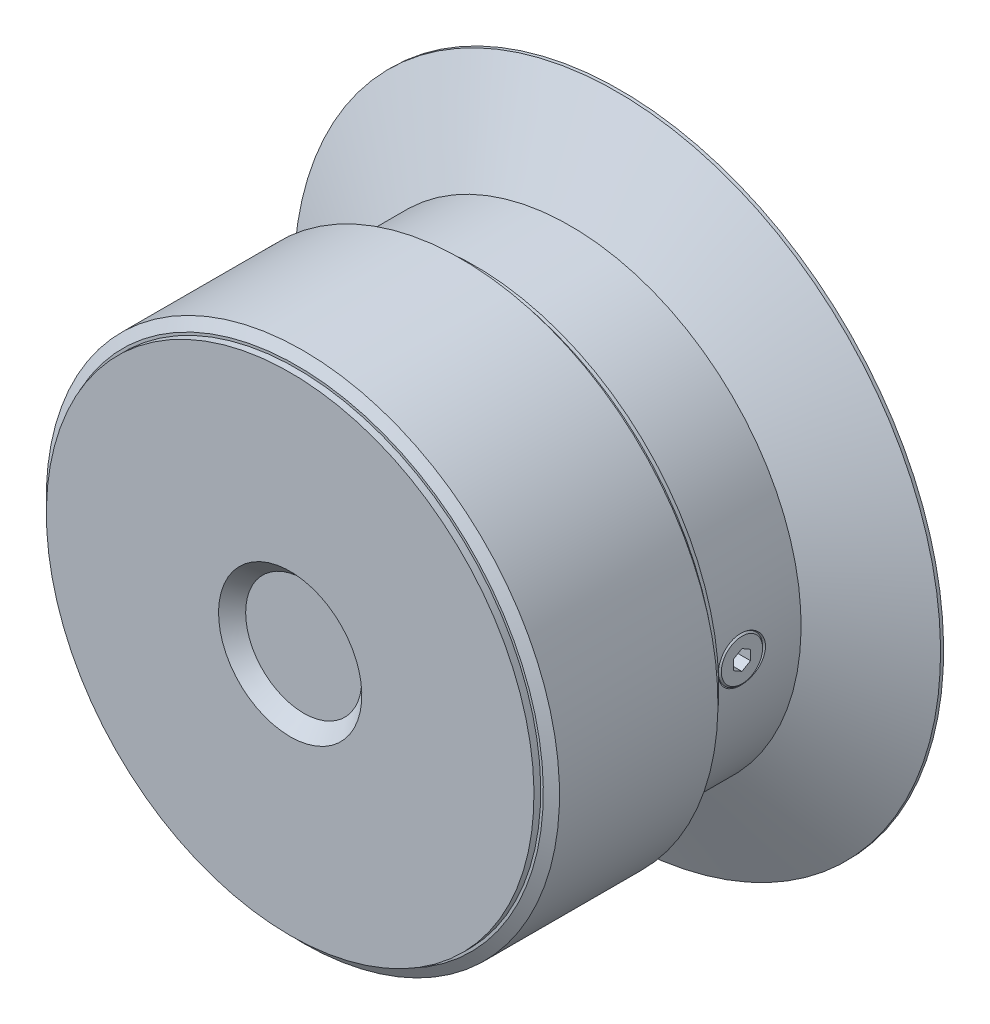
ISO-10303-21;
HEADER;
FILE_DESCRIPTION(('STEP AP214'),'2;1');
FILE_NAME('part.step','',(''),(''),'','','');
FILE_SCHEMA(('AUTOMOTIVE_DESIGN { 1 0 10303 214 1 1 1 1 }'));
ENDSEC;
DATA;
#1=APPLICATION_CONTEXT('core data for automotive mechanical design processes');
#2=APPLICATION_PROTOCOL_DEFINITION('international standard','automotive_design',2000,#1);
#3=PRODUCT_CONTEXT('',#1,'mechanical');
#4=PRODUCT('Part','Part','',(#3));
#5=PRODUCT_RELATED_PRODUCT_CATEGORY('part','',(#4));
#6=PRODUCT_DEFINITION_FORMATION('','',#4);
#7=PRODUCT_DEFINITION_CONTEXT('part definition',#1,'design');
#8=PRODUCT_DEFINITION('design','',#6,#7);
#9=PRODUCT_DEFINITION_SHAPE('','',#8);
#10=(LENGTH_UNIT() NAMED_UNIT(*) SI_UNIT(.MILLI.,.METRE.));
#11=(NAMED_UNIT(*) PLANE_ANGLE_UNIT() SI_UNIT($,.RADIAN.));
#12=(NAMED_UNIT(*) SI_UNIT($,.STERADIAN.) SOLID_ANGLE_UNIT());
#13=UNCERTAINTY_MEASURE_WITH_UNIT(LENGTH_MEASURE(1.E-05),#10,'distance_accuracy_value','');
#14=(GEOMETRIC_REPRESENTATION_CONTEXT(3) GLOBAL_UNCERTAINTY_ASSIGNED_CONTEXT((#13)) GLOBAL_UNIT_ASSIGNED_CONTEXT((#10,
#11,#12)) REPRESENTATION_CONTEXT('',''));
#15=CARTESIAN_POINT('',(0.,0.,0.));
#16=DIRECTION('',(0.,0.,1.));
#17=DIRECTION('',(1.,0.,0.));
#18=AXIS2_PLACEMENT_3D('',#15,#16,#17);
#19=CARTESIAN_POINT('',(0.,0.,33.));
#20=DIRECTION('',(0.,0.,1.));
#21=DIRECTION('',(0.,-1.,0.));
#22=AXIS2_PLACEMENT_3D('',#19,#20,#21);
#23=CYLINDRICAL_SURFACE('',#22,25.);
#24=CARTESIAN_POINT('',(0.,0.,31.7626497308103));
#25=DIRECTION('',(0.,0.,-1.));
#26=DIRECTION('',(0.,1.,0.));
#27=AXIS2_PLACEMENT_3D('',#24,#25,#26);
#28=CIRCLE('',#27,25.);
#29=CARTESIAN_POINT('',(0.,25.,31.7626497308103));
#30=VERTEX_POINT('',#29);
#31=EDGE_CURVE('E139',#30,#30,#28,.T.);
#32=ORIENTED_EDGE('',*,*,#31,.T.);
#33=EDGE_LOOP('',(#32));
#34=FACE_BOUND('',#33,.T.);
#35=CARTESIAN_POINT('',(0.,0.,16.3273502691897));
#36=DIRECTION('',(0.,0.,1.));
#37=DIRECTION('',(0.,-1.,0.));
#38=AXIS2_PLACEMENT_3D('',#35,#36,#37);
#39=CIRCLE('',#38,25.);
#40=CARTESIAN_POINT('',(0.,-25.,16.3273502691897));
#41=VERTEX_POINT('',#40);
#42=EDGE_CURVE('E142',#41,#41,#39,.T.);
#43=ORIENTED_EDGE('',*,*,#42,.T.);
#44=EDGE_LOOP('',(#43));
#45=FACE_BOUND('',#44,.T.);
#46=ADVANCED_FACE('F14',(#34,#45),#23,.T.);
#47=CARTESIAN_POINT('',(0.,0.,15.75));
#48=DIRECTION('',(0.,0.,1.));
#49=DIRECTION('',(0.,-1.,0.));
#50=AXIS2_PLACEMENT_3D('',#47,#48,#49);
#51=CONICAL_SURFACE('',#50,24.,1.0471975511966);
#52=ORIENTED_EDGE('',*,*,#42,.F.);
#53=EDGE_LOOP('',(#52));
#54=FACE_BOUND('',#53,.T.);
#55=CARTESIAN_POINT('',(0.,0.,15.75));
#56=DIRECTION('',(0.,0.,1.));
#57=DIRECTION('',(0.,-1.,0.));
#58=AXIS2_PLACEMENT_3D('',#55,#56,#57);
#59=CIRCLE('',#58,24.);
#60=CARTESIAN_POINT('',(0.,-24.,15.75));
#61=VERTEX_POINT('',#60);
#62=EDGE_CURVE('E135',#61,#61,#59,.T.);
#63=ORIENTED_EDGE('',*,*,#62,.T.);
#64=EDGE_LOOP('',(#63));
#65=FACE_BOUND('',#64,.T.);
#66=ADVANCED_FACE('F238',(#54,#65),#51,.T.);
#67=CARTESIAN_POINT('',(0.,0.,33.));
#68=DIRECTION('',(0.,0.,1.));
#69=DIRECTION('',(0.,-1.,0.));
#70=AXIS2_PLACEMENT_3D('',#67,#68,#69);
#71=CYLINDRICAL_SURFACE('',#70,24.);
#72=ORIENTED_EDGE('',*,*,#62,.F.);
#73=EDGE_LOOP('',(#72));
#74=FACE_BOUND('',#73,.T.);
#75=CARTESIAN_POINT('',(0.,0.,15.51));
#76=DIRECTION('',(0.,0.,1.));
#77=DIRECTION('',(0.,-1.,0.));
#78=AXIS2_PLACEMENT_3D('',#75,#76,#77);
#79=CIRCLE('',#78,24.);
#80=CARTESIAN_POINT('',(0.,-24.,15.51));
#81=VERTEX_POINT('',#80);
#82=EDGE_CURVE('E145',#81,#81,#79,.F.);
#83=ORIENTED_EDGE('',*,*,#82,.F.);
#84=EDGE_LOOP('',(#83));
#85=FACE_BOUND('',#84,.T.);
#86=ADVANCED_FACE('F244',(#74,#85),#71,.T.);
#87=CARTESIAN_POINT('',(23.75,0.,15.51));
#88=DIRECTION('',(0.,0.,1.));
#89=DIRECTION('',(0.,-1.,0.));
#90=AXIS2_PLACEMENT_3D('',#87,#88,#89);
#91=PLANE('',#90);
#92=ORIENTED_EDGE('',*,*,#82,.T.);
#93=EDGE_LOOP('',(#92));
#94=FACE_BOUND('',#93,.T.);
#95=CARTESIAN_POINT('',(0.,0.,15.51));
#96=DIRECTION('',(0.,0.,1.));
#97=DIRECTION('',(0.,-1.,0.));
#98=AXIS2_PLACEMENT_3D('',#95,#96,#97);
#99=CIRCLE('',#98,23.75);
#100=CARTESIAN_POINT('',(0.,-23.75,15.51));
#101=VERTEX_POINT('',#100);
#102=EDGE_CURVE('E163',#101,#101,#99,.T.);
#103=ORIENTED_EDGE('',*,*,#102,.T.);
#104=EDGE_LOOP('',(#103));
#105=FACE_BOUND('',#104,.T.);
#106=ADVANCED_FACE('F240',(#94,#105),#91,.F.);
#107=CARTESIAN_POINT('',(0.,0.,33.));
#108=DIRECTION('',(0.,0.,1.));
#109=DIRECTION('',(0.,-1.,0.));
#110=AXIS2_PLACEMENT_3D('',#107,#108,#109);
#111=CYLINDRICAL_SURFACE('',#110,23.75);
#112=ORIENTED_EDGE('',*,*,#102,.F.);
#113=EDGE_LOOP('',(#112));
#114=FACE_BOUND('',#113,.T.);
#115=CARTESIAN_POINT('',(0.,0.,15.));
#116=DIRECTION('',(0.,0.,1.));
#117=DIRECTION('',(0.,-1.,0.));
#118=AXIS2_PLACEMENT_3D('',#115,#116,#117);
#119=CIRCLE('',#118,23.75);
#120=CARTESIAN_POINT('',(0.,-23.75,15.));
#121=VERTEX_POINT('',#120);
#122=EDGE_CURVE('E166',#121,#121,#119,.T.);
#123=ORIENTED_EDGE('',*,*,#122,.T.);
#124=EDGE_LOOP('',(#123));
#125=FACE_BOUND('',#124,.T.);
#126=ADVANCED_FACE('F243',(#114,#125),#111,.T.);
#127=CARTESIAN_POINT('',(22.5,0.,15.));
#128=DIRECTION('',(0.,0.,1.));
#129=DIRECTION('',(0.,-1.,0.));
#130=AXIS2_PLACEMENT_3D('',#127,#128,#129);
#131=PLANE('',#130);
#132=ORIENTED_EDGE('',*,*,#122,.F.);
#133=EDGE_LOOP('',(#132));
#134=FACE_BOUND('',#133,.T.);
#135=CARTESIAN_POINT('',(0.,0.,15.));
#136=DIRECTION('',(0.,0.,1.));
#137=DIRECTION('',(0.,-1.,0.));
#138=AXIS2_PLACEMENT_3D('',#135,#136,#137);
#139=CIRCLE('',#138,22.5);
#140=CARTESIAN_POINT('',(0.,-22.5,15.));
#141=VERTEX_POINT('',#140);
#142=EDGE_CURVE('E169',#141,#141,#139,.T.);
#143=ORIENTED_EDGE('',*,*,#142,.T.);
#144=EDGE_LOOP('',(#143));
#145=FACE_BOUND('',#144,.T.);
#146=ADVANCED_FACE('F248',(#134,#145),#131,.F.);
#147=CARTESIAN_POINT('',(0.,0.,33.));
#148=DIRECTION('',(0.,0.,1.));
#149=DIRECTION('',(0.,-1.,0.));
#150=AXIS2_PLACEMENT_3D('',#147,#148,#149);
#151=CYLINDRICAL_SURFACE('',#150,22.5);
#152=ORIENTED_EDGE('',*,*,#142,.F.);
#153=EDGE_LOOP('',(#152));
#154=FACE_BOUND('',#153,.T.);
#155=CARTESIAN_POINT('',(22.4449005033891,-1.57367131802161,9.89902003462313));
#156=CARTESIAN_POINT('',(22.4501885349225,-1.49824527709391,9.81746639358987));
#157=CARTESIAN_POINT('',(22.4555177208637,-1.41678298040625,9.74147847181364));
#158=CARTESIAN_POINT('',(22.4657900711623,-1.24331217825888,9.60255135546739));
#159=CARTESIAN_POINT('',(22.470733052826,-1.15129873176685,9.53961831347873));
#160=CARTESIAN_POINT('',(22.4803216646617,-0.946988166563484,9.42188347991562));
#161=CARTESIAN_POINT('',(22.4848595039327,-0.833583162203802,9.3689782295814));
#162=CARTESIAN_POINT('',(22.4923255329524,-0.599185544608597,9.28386215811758));
#163=CARTESIAN_POINT('',(22.4952536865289,-0.478192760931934,9.25165180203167));
#164=CARTESIAN_POINT('',(22.499053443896,-0.237595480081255,9.21014008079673));
#165=CARTESIAN_POINT('',(22.5000069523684,-0.118149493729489,9.19992560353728));
#166=CARTESIAN_POINT('',(22.4999929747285,0.120711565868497,9.20007518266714));
#167=CARTESIAN_POINT('',(22.4990258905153,0.240126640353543,9.21043493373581));
#168=CARTESIAN_POINT('',(22.4953234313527,0.472989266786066,9.25089596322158));
#169=CARTESIAN_POINT('',(22.4926247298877,0.5865089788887,9.28058799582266));
#170=CARTESIAN_POINT('',(22.4857918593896,0.807062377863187,9.35823586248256));
#171=CARTESIAN_POINT('',(22.4816575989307,0.9140956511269,9.40619285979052));
#172=CARTESIAN_POINT('',(22.4723134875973,1.12072305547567,9.51972202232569));
#173=CARTESIAN_POINT('',(22.4670863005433,1.22015686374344,9.58558399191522));
#174=CARTESIAN_POINT('',(22.4561529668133,1.40711810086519,9.7324165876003));
#175=CARTESIAN_POINT('',(22.4504467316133,1.49464332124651,9.81339000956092));
#176=CARTESIAN_POINT('',(22.4388879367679,1.65934563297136,9.99184784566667));
#177=CARTESIAN_POINT('',(22.4330396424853,1.73591558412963,10.0898926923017));
#178=CARTESIAN_POINT('',(22.4220639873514,1.87236355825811,10.2970114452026));
#179=CARTESIAN_POINT('',(22.4169367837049,1.93223794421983,10.4060877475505));
#180=CARTESIAN_POINT('',(22.4077217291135,2.03638851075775,10.6374772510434));
#181=CARTESIAN_POINT('',(22.4036914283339,2.07983597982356,10.7601661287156));
#182=CARTESIAN_POINT('',(22.3974264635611,2.1462538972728,11.011012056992));
#183=CARTESIAN_POINT('',(22.3951921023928,2.16922089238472,11.1391700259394));
#184=CARTESIAN_POINT('',(22.3927228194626,2.19457076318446,11.4013368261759));
#185=CARTESIAN_POINT('',(22.3925485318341,2.19632944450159,11.535406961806));
#186=CARTESIAN_POINT('',(22.394377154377,2.17760329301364,11.8019791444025));
#187=CARTESIAN_POINT('',(22.3963802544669,2.15711651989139,11.9344810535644));
#188=CARTESIAN_POINT('',(22.4023598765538,2.09410479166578,12.1951352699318));
#189=CARTESIAN_POINT('',(22.4063507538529,2.05141942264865,12.3232485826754));
#190=CARTESIAN_POINT('',(22.4158499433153,1.94486944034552,12.5703021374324));
#191=CARTESIAN_POINT('',(22.4213582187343,1.88100533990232,12.6892426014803));
#192=CARTESIAN_POINT('',(22.4331417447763,1.73477050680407,12.9124375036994));
#193=CARTESIAN_POINT('',(22.4394035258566,1.65270760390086,13.0168940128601));
#194=CARTESIAN_POINT('',(22.4520098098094,1.47155370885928,13.2098357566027));
#195=CARTESIAN_POINT('',(22.4583542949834,1.37246630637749,13.29832435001));
#196=CARTESIAN_POINT('',(22.470099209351,1.16408331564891,13.4530531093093));
#197=CARTESIAN_POINT('',(22.4755266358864,1.05532978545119,13.5200205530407));
#198=CARTESIAN_POINT('',(22.4850604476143,0.827649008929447,13.633694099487));
#199=CARTESIAN_POINT('',(22.4891672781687,0.708725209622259,13.6804070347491));
#200=CARTESIAN_POINT('',(22.4953843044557,0.470322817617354,13.7499424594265));
#201=CARTESIAN_POINT('',(22.4975819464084,0.351152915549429,13.7738170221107));
#202=CARTESIAN_POINT('',(22.5000502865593,0.110467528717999,13.8005822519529));
#203=CARTESIAN_POINT('',(22.500321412,-0.0110474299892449,13.8034775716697));
#204=CARTESIAN_POINT('',(22.4989278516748,-0.248912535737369,13.7884205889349));
#205=CARTESIAN_POINT('',(22.4973237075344,-0.365305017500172,13.7711203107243));
#206=CARTESIAN_POINT('',(22.492459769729,-0.593539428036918,13.7173905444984));
#207=CARTESIAN_POINT('',(22.4891999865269,-0.705381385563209,13.6809611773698));
#208=CARTESIAN_POINT('',(22.4813606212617,-0.922094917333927,13.5900276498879));
#209=CARTESIAN_POINT('',(22.4767740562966,-1.02692590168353,13.5354276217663));
#210=CARTESIAN_POINT('',(22.466776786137,-1.22634675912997,13.4100275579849));
#211=CARTESIAN_POINT('',(22.461365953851,-1.32093504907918,13.3392250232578));
#212=CARTESIAN_POINT('',(22.4500659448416,-1.50099631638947,13.1806812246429));
#213=CARTESIAN_POINT('',(22.4441664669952,-1.58600048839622,13.0924086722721));
#214=CARTESIAN_POINT('',(22.4326929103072,-1.74078361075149,12.9033846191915));
#215=CARTESIAN_POINT('',(22.4271189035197,-1.81055919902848,12.8026303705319));
#216=CARTESIAN_POINT('',(22.4166176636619,-1.93634626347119,12.5864126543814));
#217=CARTESIAN_POINT('',(22.4117332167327,-1.99155539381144,12.4704800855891));
#218=CARTESIAN_POINT('',(22.4034617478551,-2.08254577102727,12.2311797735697));
#219=CARTESIAN_POINT('',(22.4000749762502,-2.11832377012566,12.1078107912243));
#220=CARTESIAN_POINT('',(22.3950672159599,-2.17064320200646,11.8524275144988));
#221=CARTESIAN_POINT('',(22.3935134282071,-2.18645396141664,11.7202618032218));
#222=CARTESIAN_POINT('',(22.3925674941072,-2.19612012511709,11.455095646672));
#223=CARTESIAN_POINT('',(22.3931758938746,-2.1899699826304,11.3220949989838));
#224=CARTESIAN_POINT('',(22.3965122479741,-2.15558362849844,11.0569945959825));
#225=CARTESIAN_POINT('',(22.3992714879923,-2.12702137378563,10.9249374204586));
#226=CARTESIAN_POINT('',(22.4066309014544,-2.04803684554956,10.6676306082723));
#227=CARTESIAN_POINT('',(22.4112299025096,-1.99762849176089,10.5423766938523));
#228=CARTESIAN_POINT('',(22.4206352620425,-1.88876288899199,10.3273285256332));
#229=CARTESIAN_POINT('',(22.4252012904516,-1.83413642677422,10.2355638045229));
#230=CARTESIAN_POINT('',(22.4347992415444,-1.71274280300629,10.0605034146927));
#231=CARTESIAN_POINT('',(22.4398309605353,-1.64598093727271,9.97720407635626));
#232=CARTESIAN_POINT('',(22.4449005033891,-1.57367131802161,9.89902003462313));
#233=B_SPLINE_CURVE_WITH_KNOTS('',3,(#155,#156,#157,#158,#159,#160,#161,#162,#163,#164,#165,
#166,#167,#168,#169,#170,#171,#172,#173,#174,#175,#176,#177,#178,#179,#180,#181,#182,#183,#184,
#185,#186,#187,#188,#189,#190,#191,#192,#193,#194,#195,#196,#197,#198,#199,#200,#201,#202,#203,
#204,#205,#206,#207,#208,#209,#210,#211,#212,#213,#214,#215,#216,#217,#218,#219,#220,#221,#222,
#223,#224,#225,#226,#227,#228,#229,#230,#231,#232),.UNSPECIFIED.,.T.,.F.,(4,2,2,2,2,2,2,2,2,2,2,
2,2,2,2,2,2,2,2,2,2,2,2,2,2,2,2,2,2,2,2,2,2,2,2,2,2,2,4),(0.,0.333338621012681,
0.666833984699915,1.04055735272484,1.41428911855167,1.77218063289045,2.12999726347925,
2.48047526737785,2.8309755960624,3.18752673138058,3.54414389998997,3.91610231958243,
4.28814170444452,4.67702111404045,5.06596608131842,5.46633130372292,5.86673145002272,
6.27006606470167,6.67339091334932,7.07035341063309,7.46723230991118,7.84878311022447,
8.23020509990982,8.59306372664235,8.95584187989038,9.3072241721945,9.65860424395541,
10.0118683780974,10.3651870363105,10.7316233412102,11.098140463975,11.481907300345,
11.8657382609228,12.2632425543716,12.6608472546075,13.0643458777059,13.4675877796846,
13.7872928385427,14.1068587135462),.UNSPECIFIED.);
#234=CARTESIAN_POINT('',(22.4449005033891,-1.57367131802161,9.89902003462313));
#235=VERTEX_POINT('',#234);
#236=EDGE_CURVE('E18',#235,#235,#233,.T.);
#237=ORIENTED_EDGE('',*,*,#236,.F.);
#238=EDGE_LOOP('',(#237));
#239=FACE_BOUND('',#238,.T.);
#240=CARTESIAN_POINT('',(0.,0.,5.73072904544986));
#241=DIRECTION('',(0.,0.,1.));
#242=DIRECTION('',(0.,-1.,0.));
#243=AXIS2_PLACEMENT_3D('',#240,#241,#242);
#244=CIRCLE('',#243,22.5);
#245=CARTESIAN_POINT('',(0.,-22.5,5.73072904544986));
#246=VERTEX_POINT('',#245);
#247=EDGE_CURVE('E172',#246,#246,#244,.T.);
#248=ORIENTED_EDGE('',*,*,#247,.T.);
#249=EDGE_LOOP('',(#248));
#250=FACE_BOUND('',#249,.T.);
#251=ADVANCED_FACE('F216',(#154,#239,#250),#151,.T.);
#252=CARTESIAN_POINT('',(22.7,0.,11.5));
#253=DIRECTION('',(1.,0.,0.));
#254=DIRECTION('',(0.,0.,-1.));
#255=AXIS2_PLACEMENT_3D('',#252,#253,#254);
#256=CONICAL_SURFACE('',#255,2.5,0.785398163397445);
#257=ORIENTED_EDGE('',*,*,#236,.T.);
#258=EDGE_LOOP('',(#257));
#259=FACE_BOUND('',#258,.T.);
#260=CARTESIAN_POINT('',(22.3596413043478,0.,11.5));
#261=DIRECTION('',(1.,0.,0.));
#262=DIRECTION('',(0.,0.,-1.));
#263=AXIS2_PLACEMENT_3D('',#260,#261,#262);
#264=CIRCLE('',#263,2.15964130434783);
#265=CARTESIAN_POINT('',(22.3596413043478,0.,9.34035869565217));
#266=VERTEX_POINT('',#265);
#267=EDGE_CURVE('E28',#266,#266,#264,.T.);
#268=ORIENTED_EDGE('',*,*,#267,.F.);
#269=EDGE_LOOP('',(#268));
#270=FACE_BOUND('',#269,.T.);
#271=ADVANCED_FACE('F211',(#259,#270),#256,.F.);
#272=CARTESIAN_POINT('',(0.,0.,1.145));
#273=DIRECTION('',(0.,0.,-1.));
#274=DIRECTION('',(0.,1.,0.));
#275=AXIS2_PLACEMENT_3D('',#272,#273,#274);
#276=CONICAL_SURFACE('',#275,31.5,1.09955742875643);
#277=ORIENTED_EDGE('',*,*,#247,.F.);
#278=EDGE_LOOP('',(#277));
#279=FACE_BOUND('',#278,.T.);
#280=CARTESIAN_POINT('',(0.,0.,1.145));
#281=DIRECTION('',(0.,0.,1.));
#282=DIRECTION('',(0.,-1.,0.));
#283=AXIS2_PLACEMENT_3D('',#280,#281,#282);
#284=CIRCLE('',#283,31.5);
#285=CARTESIAN_POINT('',(0.,-31.5,1.145));
#286=VERTEX_POINT('',#285);
#287=EDGE_CURVE('E175',#286,#286,#284,.T.);
#288=ORIENTED_EDGE('',*,*,#287,.T.);
#289=EDGE_LOOP('',(#288));
#290=FACE_BOUND('',#289,.T.);
#291=ADVANCED_FACE('F215',(#279,#290),#276,.T.);
#292=CARTESIAN_POINT('',(22.5097826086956,0.,11.5));
#293=DIRECTION('',(-1.,0.,0.));
#294=DIRECTION('',(0.,-1.,0.));
#295=AXIS2_PLACEMENT_3D('',#292,#293,#294);
#296=CONICAL_SURFACE('',#295,2.0095,0.785398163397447);
#297=ORIENTED_EDGE('',*,*,#267,.T.);
#298=EDGE_LOOP('',(#297));
#299=FACE_BOUND('',#298,.T.);
#300=CARTESIAN_POINT('',(22.5097826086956,0.,11.5));
#301=DIRECTION('',(-1.,0.,0.));
#302=DIRECTION('',(0.,-1.,0.));
#303=AXIS2_PLACEMENT_3D('',#300,#301,#302);
#304=CIRCLE('',#303,2.0095);
#305=CARTESIAN_POINT('',(22.5097826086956,-2.0095,11.5));
#306=VERTEX_POINT('',#305);
#307=EDGE_CURVE('E80',#306,#306,#304,.T.);
#308=ORIENTED_EDGE('',*,*,#307,.T.);
#309=EDGE_LOOP('',(#308));
#310=FACE_BOUND('',#309,.T.);
#311=ADVANCED_FACE('F258',(#299,#310),#296,.T.);
#312=CARTESIAN_POINT('',(0.,0.,33.));
#313=DIRECTION('',(0.,0.,1.));
#314=DIRECTION('',(0.,-1.,0.));
#315=AXIS2_PLACEMENT_3D('',#312,#313,#314);
#316=CYLINDRICAL_SURFACE('',#315,31.5);
#317=ORIENTED_EDGE('',*,*,#287,.F.);
#318=EDGE_LOOP('',(#317));
#319=FACE_BOUND('',#318,.T.);
#320=CARTESIAN_POINT('',(0.,0.,0.845));
#321=DIRECTION('',(0.,0.,1.));
#322=DIRECTION('',(0.,-1.,0.));
#323=AXIS2_PLACEMENT_3D('',#320,#321,#322);
#324=CIRCLE('',#323,31.5);
#325=CARTESIAN_POINT('',(0.,-31.5,0.845));
#326=VERTEX_POINT('',#325);
#327=EDGE_CURVE('E178',#326,#326,#324,.T.);
#328=ORIENTED_EDGE('',*,*,#327,.T.);
#329=EDGE_LOOP('',(#328));
#330=FACE_BOUND('',#329,.T.);
#331=ADVANCED_FACE('F260',(#319,#330),#316,.T.);
#332=CARTESIAN_POINT('',(22.5097826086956,0.,11.5));
#333=DIRECTION('',(-1.,0.,0.));
#334=DIRECTION('',(0.,-1.,0.));
#335=AXIS2_PLACEMENT_3D('',#332,#333,#334);
#336=PLANE('',#335);
#337=ORIENTED_EDGE('',*,*,#307,.F.);
#338=EDGE_LOOP('',(#337));
#339=FACE_BOUND('',#338,.T.);
#340=DIRECTION('',(0.,1.,0.));
#341=VECTOR('',#340,1.);
#342=CARTESIAN_POINT('',(22.5097826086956,0.,10.6666666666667));
#343=LINE('',#342,#341);
#344=CARTESIAN_POINT('',(22.5097826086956,-0.48112522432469,10.6666666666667));
#345=VERTEX_POINT('',#344);
#346=CARTESIAN_POINT('',(22.5097826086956,0.481125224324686,10.6666666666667));
#347=VERTEX_POINT('',#346);
#348=EDGE_CURVE('E44',#345,#347,#343,.T.);
#349=ORIENTED_EDGE('',*,*,#348,.F.);
#350=DIRECTION('',(0.,0.5,-0.866025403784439));
#351=VECTOR('',#350,1.);
#352=CARTESIAN_POINT('',(22.5097826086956,-0.721687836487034,11.0833333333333));
#353=LINE('',#352,#351);
#354=CARTESIAN_POINT('',(22.5097826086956,-0.962250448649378,11.5));
#355=VERTEX_POINT('',#354);
#356=EDGE_CURVE('E118',#355,#345,#353,.T.);
#357=ORIENTED_EDGE('',*,*,#356,.F.);
#358=DIRECTION('',(0.,-0.5,-0.866025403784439));
#359=VECTOR('',#358,1.);
#360=CARTESIAN_POINT('',(22.5097826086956,-0.721687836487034,11.9166666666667));
#361=LINE('',#360,#359);
#362=CARTESIAN_POINT('',(22.5097826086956,-0.48112522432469,12.3333333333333));
#363=VERTEX_POINT('',#362);
#364=EDGE_CURVE('E120',#363,#355,#361,.T.);
#365=ORIENTED_EDGE('',*,*,#364,.F.);
#366=DIRECTION('',(0.,-1.,0.));
#367=VECTOR('',#366,1.);
#368=CARTESIAN_POINT('',(22.5097826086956,0.,12.3333333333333));
#369=LINE('',#368,#367);
#370=CARTESIAN_POINT('',(22.5097826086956,0.481125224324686,12.3333333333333));
#371=VERTEX_POINT('',#370);
#372=EDGE_CURVE('E122',#371,#363,#369,.T.);
#373=ORIENTED_EDGE('',*,*,#372,.F.);
#374=DIRECTION('',(0.,-0.5,0.866025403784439));
#375=VECTOR('',#374,1.);
#376=CARTESIAN_POINT('',(22.5097826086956,0.72168783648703,11.9166666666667));
#377=LINE('',#376,#375);
#378=CARTESIAN_POINT('',(22.5097826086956,0.962250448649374,11.5));
#379=VERTEX_POINT('',#378);
#380=EDGE_CURVE('E124',#379,#371,#377,.T.);
#381=ORIENTED_EDGE('',*,*,#380,.F.);
#382=DIRECTION('',(0.,0.5,0.866025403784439));
#383=VECTOR('',#382,1.);
#384=CARTESIAN_POINT('',(22.5097826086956,0.72168783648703,11.0833333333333));
#385=LINE('',#384,#383);
#386=EDGE_CURVE('E127',#347,#379,#385,.T.);
#387=ORIENTED_EDGE('',*,*,#386,.F.);
#388=EDGE_LOOP('',(#349,#357,#365,#373,#381,#387));
#389=FACE_BOUND('',#388,.T.);
#390=ADVANCED_FACE('F263',(#339,#389),#336,.F.);
#391=CARTESIAN_POINT('',(11.,0.,0.845));
#392=DIRECTION('',(0.,0.,1.));
#393=DIRECTION('',(0.,-1.,0.));
#394=AXIS2_PLACEMENT_3D('',#391,#392,#393);
#395=PLANE('',#394);
#396=ORIENTED_EDGE('',*,*,#327,.F.);
#397=EDGE_LOOP('',(#396));
#398=FACE_BOUND('',#397,.T.);
#399=CARTESIAN_POINT('',(0.,0.,0.845));
#400=DIRECTION('',(0.,0.,1.));
#401=DIRECTION('',(0.,-1.,0.));
#402=AXIS2_PLACEMENT_3D('',#399,#400,#401);
#403=CIRCLE('',#402,11.);
#404=CARTESIAN_POINT('',(0.,-11.,0.845));
#405=VERTEX_POINT('',#404);
#406=EDGE_CURVE('E181',#405,#405,#403,.T.);
#407=ORIENTED_EDGE('',*,*,#406,.T.);
#408=EDGE_LOOP('',(#407));
#409=FACE_BOUND('',#408,.T.);
#410=ADVANCED_FACE('F265',(#398,#409),#395,.F.);
#411=CARTESIAN_POINT('',(24.5,-0.48112522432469,10.6666666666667));
#412=DIRECTION('',(0.,0.,1.));
#413=DIRECTION('',(0.,-1.,0.));
#414=AXIS2_PLACEMENT_3D('',#411,#412,#413);
#415=PLANE('',#414);
#416=ORIENTED_EDGE('',*,*,#348,.T.);
#417=DIRECTION('',(-1.,0.,0.));
#418=VECTOR('',#417,1.);
#419=CARTESIAN_POINT('',(24.5,0.481125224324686,10.6666666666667));
#420=LINE('',#419,#418);
#421=CARTESIAN_POINT('',(20.5,0.481125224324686,10.6666666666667));
#422=VERTEX_POINT('',#421);
#423=EDGE_CURVE('E73',#347,#422,#420,.T.);
#424=ORIENTED_EDGE('',*,*,#423,.T.);
#425=DIRECTION('',(0.,1.,0.));
#426=VECTOR('',#425,1.);
#427=CARTESIAN_POINT('',(20.5,-0.48112522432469,10.6666666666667));
#428=LINE('',#427,#426);
#429=CARTESIAN_POINT('',(20.5,-0.48112522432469,10.6666666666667));
#430=VERTEX_POINT('',#429);
#431=EDGE_CURVE('E77',#430,#422,#428,.T.);
#432=ORIENTED_EDGE('',*,*,#431,.F.);
#433=DIRECTION('',(-1.,0.,0.));
#434=VECTOR('',#433,1.);
#435=CARTESIAN_POINT('',(24.5,-0.48112522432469,10.6666666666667));
#436=LINE('',#435,#434);
#437=EDGE_CURVE('E108',#345,#430,#436,.T.);
#438=ORIENTED_EDGE('',*,*,#437,.F.);
#439=EDGE_LOOP('',(#416,#424,#432,#438));
#440=FACE_BOUND('',#439,.T.);
#441=ADVANCED_FACE('F75',(#440),#415,.T.);
#442=CARTESIAN_POINT('',(24.5,-0.962250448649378,11.5));
#443=DIRECTION('',(0.,0.866025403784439,0.5));
#444=DIRECTION('',(0.,-0.5,0.866025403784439));
#445=AXIS2_PLACEMENT_3D('',#442,#443,#444);
#446=PLANE('',#445);
#447=ORIENTED_EDGE('',*,*,#356,.T.);
#448=ORIENTED_EDGE('',*,*,#437,.T.);
#449=DIRECTION('',(0.,0.5,-0.866025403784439));
#450=VECTOR('',#449,1.);
#451=CARTESIAN_POINT('',(20.5,-0.962250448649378,11.5));
#452=LINE('',#451,#450);
#453=CARTESIAN_POINT('',(20.5,-0.962250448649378,11.5));
#454=VERTEX_POINT('',#453);
#455=EDGE_CURVE('E95',#454,#430,#452,.T.);
#456=ORIENTED_EDGE('',*,*,#455,.F.);
#457=DIRECTION('',(-1.,0.,0.));
#458=VECTOR('',#457,1.);
#459=CARTESIAN_POINT('',(24.5,-0.962250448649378,11.5));
#460=LINE('',#459,#458);
#461=EDGE_CURVE('E36',#355,#454,#460,.T.);
#462=ORIENTED_EDGE('',*,*,#461,.F.);
#463=EDGE_LOOP('',(#447,#448,#456,#462));
#464=FACE_BOUND('',#463,.T.);
#465=ADVANCED_FACE('F415',(#464),#446,.T.);
#466=CARTESIAN_POINT('',(24.5,-0.48112522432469,12.3333333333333));
#467=DIRECTION('',(0.,0.866025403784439,-0.5));
#468=DIRECTION('',(0.,0.5,0.866025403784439));
#469=AXIS2_PLACEMENT_3D('',#466,#467,#468);
#470=PLANE('',#469);
#471=ORIENTED_EDGE('',*,*,#364,.T.);
#472=ORIENTED_EDGE('',*,*,#461,.T.);
#473=DIRECTION('',(0.,-0.5,-0.866025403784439));
#474=VECTOR('',#473,1.);
#475=CARTESIAN_POINT('',(20.5,-0.48112522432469,12.3333333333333));
#476=LINE('',#475,#474);
#477=CARTESIAN_POINT('',(20.5,-0.48112522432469,12.3333333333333));
#478=VERTEX_POINT('',#477);
#479=EDGE_CURVE('E105',#478,#454,#476,.T.);
#480=ORIENTED_EDGE('',*,*,#479,.F.);
#481=DIRECTION('',(-1.,0.,0.));
#482=VECTOR('',#481,1.);
#483=CARTESIAN_POINT('',(24.5,-0.48112522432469,12.3333333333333));
#484=LINE('',#483,#482);
#485=EDGE_CURVE('E111',#363,#478,#484,.T.);
#486=ORIENTED_EDGE('',*,*,#485,.F.);
#487=EDGE_LOOP('',(#471,#472,#480,#486));
#488=FACE_BOUND('',#487,.T.);
#489=ADVANCED_FACE('F414',(#488),#470,.T.);
#490=CARTESIAN_POINT('',(24.5,0.481125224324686,12.3333333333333));
#491=DIRECTION('',(0.,0.,-1.));
#492=DIRECTION('',(0.,1.,0.));
#493=AXIS2_PLACEMENT_3D('',#490,#491,#492);
#494=PLANE('',#493);
#495=DIRECTION('',(-1.,0.,0.));
#496=VECTOR('',#495,1.);
#497=CARTESIAN_POINT('',(24.5,0.481125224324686,12.3333333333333));
#498=LINE('',#497,#496);
#499=CARTESIAN_POINT('',(20.5,0.481125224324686,12.3333333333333));
#500=VERTEX_POINT('',#499);
#501=EDGE_CURVE('E113',#371,#500,#498,.T.);
#502=ORIENTED_EDGE('',*,*,#501,.F.);
#503=ORIENTED_EDGE('',*,*,#372,.T.);
#504=ORIENTED_EDGE('',*,*,#485,.T.);
#505=DIRECTION('',(0.,-1.,0.));
#506=VECTOR('',#505,1.);
#507=CARTESIAN_POINT('',(20.5,0.481125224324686,12.3333333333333));
#508=LINE('',#507,#506);
#509=EDGE_CURVE('E102',#500,#478,#508,.T.);
#510=ORIENTED_EDGE('',*,*,#509,.F.);
#511=EDGE_LOOP('',(#502,#503,#504,#510));
#512=FACE_BOUND('',#511,.T.);
#513=ADVANCED_FACE('F411',(#512),#494,.T.);
#514=CARTESIAN_POINT('',(24.5,0.962250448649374,11.5));
#515=DIRECTION('',(0.,-0.866025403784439,-0.5));
#516=DIRECTION('',(0.,0.5,-0.866025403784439));
#517=AXIS2_PLACEMENT_3D('',#514,#515,#516);
#518=PLANE('',#517);
#519=ORIENTED_EDGE('',*,*,#380,.T.);
#520=ORIENTED_EDGE('',*,*,#501,.T.);
#521=DIRECTION('',(0.,-0.5,0.866025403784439));
#522=VECTOR('',#521,1.);
#523=CARTESIAN_POINT('',(20.5,0.962250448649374,11.5));
#524=LINE('',#523,#522);
#525=CARTESIAN_POINT('',(20.5,0.962250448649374,11.5));
#526=VERTEX_POINT('',#525);
#527=EDGE_CURVE('E90',#526,#500,#524,.T.);
#528=ORIENTED_EDGE('',*,*,#527,.F.);
#529=DIRECTION('',(-1.,0.,0.));
#530=VECTOR('',#529,1.);
#531=CARTESIAN_POINT('',(24.5,0.962250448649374,11.5));
#532=LINE('',#531,#530);
#533=EDGE_CURVE('E81',#379,#526,#532,.T.);
#534=ORIENTED_EDGE('',*,*,#533,.F.);
#535=EDGE_LOOP('',(#519,#520,#528,#534));
#536=FACE_BOUND('',#535,.T.);
#537=ADVANCED_FACE('F406',(#536),#518,.T.);
#538=CARTESIAN_POINT('',(24.5,0.481125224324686,10.6666666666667));
#539=DIRECTION('',(0.,-0.866025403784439,0.5));
#540=DIRECTION('',(0.,-0.5,-0.866025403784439));
#541=AXIS2_PLACEMENT_3D('',#538,#539,#540);
#542=PLANE('',#541);
#543=ORIENTED_EDGE('',*,*,#386,.T.);
#544=ORIENTED_EDGE('',*,*,#533,.T.);
#545=DIRECTION('',(0.,0.5,0.866025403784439));
#546=VECTOR('',#545,1.);
#547=CARTESIAN_POINT('',(20.5,0.481125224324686,10.6666666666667));
#548=LINE('',#547,#546);
#549=EDGE_CURVE('E84',#422,#526,#548,.T.);
#550=ORIENTED_EDGE('',*,*,#549,.F.);
#551=ORIENTED_EDGE('',*,*,#423,.F.);
#552=EDGE_LOOP('',(#543,#544,#550,#551));
#553=FACE_BOUND('',#552,.T.);
#554=ADVANCED_FACE('F85',(#553),#542,.T.);
#555=CARTESIAN_POINT('',(0.,0.,0.3));
#556=DIRECTION('',(0.,0.,1.));
#557=DIRECTION('',(0.,-1.,0.));
#558=AXIS2_PLACEMENT_3D('',#555,#556,#557);
#559=CONICAL_SURFACE('',#558,10.,1.0717999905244);
#560=ORIENTED_EDGE('',*,*,#406,.F.);
#561=EDGE_LOOP('',(#560));
#562=FACE_BOUND('',#561,.T.);
#563=CARTESIAN_POINT('',(0.,0.,0.3));
#564=DIRECTION('',(0.,0.,1.));
#565=DIRECTION('',(0.,-1.,0.));
#566=AXIS2_PLACEMENT_3D('',#563,#564,#565);
#567=CIRCLE('',#566,10.);
#568=CARTESIAN_POINT('',(0.,-10.,0.3));
#569=VERTEX_POINT('',#568);
#570=EDGE_CURVE('E184',#569,#569,#567,.T.);
#571=ORIENTED_EDGE('',*,*,#570,.T.);
#572=EDGE_LOOP('',(#571));
#573=FACE_BOUND('',#572,.T.);
#574=ADVANCED_FACE('F269',(#562,#573),#559,.T.);
#575=CARTESIAN_POINT('',(20.5,0.,11.5));
#576=DIRECTION('',(1.,0.,0.));
#577=DIRECTION('',(0.,1.,0.));
#578=AXIS2_PLACEMENT_3D('',#575,#576,#577);
#579=PLANE('',#578);
#580=ORIENTED_EDGE('',*,*,#431,.T.);
#581=ORIENTED_EDGE('',*,*,#549,.T.);
#582=ORIENTED_EDGE('',*,*,#527,.T.);
#583=ORIENTED_EDGE('',*,*,#509,.T.);
#584=ORIENTED_EDGE('',*,*,#479,.T.);
#585=ORIENTED_EDGE('',*,*,#455,.T.);
#586=EDGE_LOOP('',(#580,#581,#582,#583,#584,#585));
#587=FACE_BOUND('',#586,.T.);
#588=ADVANCED_FACE('F93',(#587),#579,.T.);
#589=CARTESIAN_POINT('',(7.5,0.,0.3));
#590=DIRECTION('',(0.,0.,1.));
#591=DIRECTION('',(0.,-1.,0.));
#592=AXIS2_PLACEMENT_3D('',#589,#590,#591);
#593=PLANE('',#592);
#594=ORIENTED_EDGE('',*,*,#570,.F.);
#595=EDGE_LOOP('',(#594));
#596=FACE_BOUND('',#595,.T.);
#597=CARTESIAN_POINT('',(0.,0.,0.3));
#598=DIRECTION('',(0.,0.,1.));
#599=DIRECTION('',(0.,-1.,0.));
#600=AXIS2_PLACEMENT_3D('',#597,#598,#599);
#601=CIRCLE('',#600,7.5);
#602=CARTESIAN_POINT('',(0.,-7.5,0.3));
#603=VERTEX_POINT('',#602);
#604=EDGE_CURVE('E187',#603,#603,#601,.T.);
#605=ORIENTED_EDGE('',*,*,#604,.T.);
#606=EDGE_LOOP('',(#605));
#607=FACE_BOUND('',#606,.T.);
#608=ADVANCED_FACE('F273',(#596,#607),#593,.F.);
#609=CARTESIAN_POINT('',(0.,0.,33.));
#610=DIRECTION('',(0.,0.,1.));
#611=DIRECTION('',(0.,-1.,0.));
#612=AXIS2_PLACEMENT_3D('',#609,#610,#611);
#613=CYLINDRICAL_SURFACE('',#612,7.5);
#614=ORIENTED_EDGE('',*,*,#604,.F.);
#615=EDGE_LOOP('',(#614));
#616=FACE_BOUND('',#615,.T.);
#617=CARTESIAN_POINT('',(0.,0.,0.));
#618=DIRECTION('',(0.,0.,1.));
#619=DIRECTION('',(0.,-1.,0.));
#620=AXIS2_PLACEMENT_3D('',#617,#618,#619);
#621=CIRCLE('',#620,7.5);
#622=CARTESIAN_POINT('',(0.,-7.5,0.));
#623=VERTEX_POINT('',#622);
#624=EDGE_CURVE('E98',#623,#623,#621,.T.);
#625=ORIENTED_EDGE('',*,*,#624,.T.);
#626=EDGE_LOOP('',(#625));
#627=FACE_BOUND('',#626,.T.);
#628=ADVANCED_FACE('F192',(#616,#627),#613,.T.);
#629=CARTESIAN_POINT('',(0.,0.,0.));
#630=DIRECTION('',(0.,0.,1.));
#631=DIRECTION('',(0.,-1.,0.));
#632=AXIS2_PLACEMENT_3D('',#629,#630,#631);
#633=PLANE('',#632);
#634=ORIENTED_EDGE('',*,*,#624,.F.);
#635=EDGE_LOOP('',(#634));
#636=FACE_BOUND('',#635,.T.);
#637=CARTESIAN_POINT('',(0.,0.,0.));
#638=DIRECTION('',(0.,0.,1.));
#639=DIRECTION('',(0.,-1.,0.));
#640=AXIS2_PLACEMENT_3D('',#637,#638,#639);
#641=CIRCLE('',#640,4.2);
#642=CARTESIAN_POINT('',(0.,-4.2,0.));
#643=VERTEX_POINT('',#642);
#644=EDGE_CURVE('E151',#643,#643,#641,.T.);
#645=ORIENTED_EDGE('',*,*,#644,.T.);
#646=EDGE_LOOP('',(#645));
#647=FACE_BOUND('',#646,.T.);
#648=ADVANCED_FACE('F16',(#636,#647),#633,.F.);
#649=CARTESIAN_POINT('',(0.,0.,0.));
#650=DIRECTION('',(0.,0.,-1.));
#651=DIRECTION('',(0.,1.,0.));
#652=AXIS2_PLACEMENT_3D('',#649,#650,#651);
#653=CONICAL_SURFACE('',#652,4.2,0.785398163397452);
#654=CARTESIAN_POINT('',(0.,0.,0.2));
#655=DIRECTION('',(0.,0.,1.));
#656=DIRECTION('',(0.,-1.,0.));
#657=AXIS2_PLACEMENT_3D('',#654,#655,#656);
#658=CIRCLE('',#657,4.);
#659=CARTESIAN_POINT('',(0.,-4.,0.2));
#660=VERTEX_POINT('',#659);
#661=EDGE_CURVE('E148',#660,#660,#658,.T.);
#662=ORIENTED_EDGE('',*,*,#661,.T.);
#663=EDGE_LOOP('',(#662));
#664=FACE_BOUND('',#663,.T.);
#665=ORIENTED_EDGE('',*,*,#644,.F.);
#666=EDGE_LOOP('',(#665));
#667=FACE_BOUND('',#666,.T.);
#668=ADVANCED_FACE('F196',(#664,#667),#653,.F.);
#669=CARTESIAN_POINT('',(0.,0.,22.3094010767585));
#670=DIRECTION('',(0.,0.,1.));
#671=DIRECTION('',(0.,-1.,0.));
#672=AXIS2_PLACEMENT_3D('',#669,#670,#671);
#673=CYLINDRICAL_SURFACE('',#672,4.);
#674=ORIENTED_EDGE('',*,*,#661,.F.);
#675=EDGE_LOOP('',(#674));
#676=FACE_BOUND('',#675,.T.);
#677=CARTESIAN_POINT('',(0.,0.,20.));
#678=DIRECTION('',(0.,0.,-1.));
#679=DIRECTION('',(0.,1.,0.));
#680=AXIS2_PLACEMENT_3D('',#677,#678,#679);
#681=CIRCLE('',#680,4.);
#682=CARTESIAN_POINT('',(0.,4.,20.));
#683=VERTEX_POINT('',#682);
#684=EDGE_CURVE('E136',#683,#683,#681,.T.);
#685=ORIENTED_EDGE('',*,*,#684,.F.);
#686=EDGE_LOOP('',(#685));
#687=FACE_BOUND('',#686,.T.);
#688=ADVANCED_FACE('F200',(#676,#687),#673,.F.);
#689=CARTESIAN_POINT('',(0.,0.,20.));
#690=DIRECTION('',(0.,0.,-1.));
#691=DIRECTION('',(0.,1.,0.));
#692=AXIS2_PLACEMENT_3D('',#689,#690,#691);
#693=PLANE('',#692);
#694=ORIENTED_EDGE('',*,*,#684,.T.);
#695=EDGE_LOOP('',(#694));
#696=FACE_BOUND('',#695,.T.);
#697=ADVANCED_FACE('F207',(#696),#693,.T.);
#698=CARTESIAN_POINT('',(5.97674418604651,0.,31.68));
#699=DIRECTION('',(0.,0.,-1.));
#700=DIRECTION('',(0.,1.,0.));
#701=AXIS2_PLACEMENT_3D('',#698,#699,#700);
#702=PLANE('',#701);
#703=CARTESIAN_POINT('',(0.,0.,31.68));
#704=DIRECTION('',(0.,0.,-1.));
#705=DIRECTION('',(0.,1.,0.));
#706=AXIS2_PLACEMENT_3D('',#703,#704,#705);
#707=CIRCLE('',#706,5.65674418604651);
#708=CARTESIAN_POINT('',(0.,5.65674418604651,31.68));
#709=VERTEX_POINT('',#708);
#710=EDGE_CURVE('E9',#709,#709,#707,.T.);
#711=ORIENTED_EDGE('',*,*,#710,.F.);
#712=EDGE_LOOP('',(#711));
#713=FACE_BOUND('',#712,.T.);
#714=ADVANCED_FACE('F222',(#713),#702,.F.);
#715=CARTESIAN_POINT('',(0.,0.,33.));
#716=DIRECTION('',(0.,0.,1.));
#717=DIRECTION('',(0.,-1.,0.));
#718=AXIS2_PLACEMENT_3D('',#715,#716,#717);
#719=CONICAL_SURFACE('',#718,6.97674418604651,0.785398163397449);
#720=CARTESIAN_POINT('',(0.,0.,33.));
#721=DIRECTION('',(0.,0.,1.));
#722=DIRECTION('',(0.,-1.,0.));
#723=AXIS2_PLACEMENT_3D('',#720,#721,#722);
#724=CIRCLE('',#723,6.97674418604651);
#725=CARTESIAN_POINT('',(0.,-6.97674418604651,33.));
#726=VERTEX_POINT('',#725);
#727=EDGE_CURVE('E154',#726,#726,#724,.T.);
#728=ORIENTED_EDGE('',*,*,#727,.T.);
#729=EDGE_LOOP('',(#728));
#730=FACE_BOUND('',#729,.T.);
#731=ORIENTED_EDGE('',*,*,#710,.T.);
#732=EDGE_LOOP('',(#731));
#733=FACE_BOUND('',#732,.T.);
#734=ADVANCED_FACE('F218',(#730,#733),#719,.F.);
#735=CARTESIAN_POINT('',(23.75,0.,33.));
#736=DIRECTION('',(0.,0.,-1.));
#737=DIRECTION('',(0.,1.,0.));
#738=AXIS2_PLACEMENT_3D('',#735,#736,#737);
#739=PLANE('',#738);
#740=ORIENTED_EDGE('',*,*,#727,.F.);
#741=EDGE_LOOP('',(#740));
#742=FACE_BOUND('',#741,.T.);
#743=CARTESIAN_POINT('',(0.,0.,33.));
#744=DIRECTION('',(0.,0.,1.));
#745=DIRECTION('',(0.,-1.,0.));
#746=AXIS2_PLACEMENT_3D('',#743,#744,#745);
#747=CIRCLE('',#746,23.75);
#748=CARTESIAN_POINT('',(0.,-23.75,33.));
#749=VERTEX_POINT('',#748);
#750=EDGE_CURVE('E157',#749,#749,#747,.T.);
#751=ORIENTED_EDGE('',*,*,#750,.T.);
#752=EDGE_LOOP('',(#751));
#753=FACE_BOUND('',#752,.T.);
#754=ADVANCED_FACE('F221',(#742,#753),#739,.F.);
#755=CARTESIAN_POINT('',(0.,0.,33.));
#756=DIRECTION('',(0.,0.,1.));
#757=DIRECTION('',(0.,-1.,0.));
#758=AXIS2_PLACEMENT_3D('',#755,#756,#757);
#759=CYLINDRICAL_SURFACE('',#758,23.75);
#760=ORIENTED_EDGE('',*,*,#750,.F.);
#761=EDGE_LOOP('',(#760));
#762=FACE_BOUND('',#761,.T.);
#763=CARTESIAN_POINT('',(0.,0.,32.34));
#764=DIRECTION('',(0.,0.,1.));
#765=DIRECTION('',(0.,-1.,0.));
#766=AXIS2_PLACEMENT_3D('',#763,#764,#765);
#767=CIRCLE('',#766,23.75);
#768=CARTESIAN_POINT('',(0.,-23.75,32.34));
#769=VERTEX_POINT('',#768);
#770=EDGE_CURVE('E160',#769,#769,#767,.T.);
#771=ORIENTED_EDGE('',*,*,#770,.T.);
#772=EDGE_LOOP('',(#771));
#773=FACE_BOUND('',#772,.T.);
#774=ADVANCED_FACE('F226',(#762,#773),#759,.T.);
#775=CARTESIAN_POINT('',(24.9,0.,32.34));
#776=DIRECTION('',(0.,0.,-1.));
#777=DIRECTION('',(0.,1.,0.));
#778=AXIS2_PLACEMENT_3D('',#775,#776,#777);
#779=PLANE('',#778);
#780=ORIENTED_EDGE('',*,*,#770,.F.);
#781=EDGE_LOOP('',(#780));
#782=FACE_BOUND('',#781,.T.);
#783=CARTESIAN_POINT('',(0.,0.,32.34));
#784=DIRECTION('',(0.,0.,1.));
#785=DIRECTION('',(0.,-1.,0.));
#786=AXIS2_PLACEMENT_3D('',#783,#784,#785);
#787=CIRCLE('',#786,24.);
#788=CARTESIAN_POINT('',(0.,-24.,32.34));
#789=VERTEX_POINT('',#788);
#790=EDGE_CURVE('E132',#789,#789,#787,.T.);
#791=ORIENTED_EDGE('',*,*,#790,.T.);
#792=EDGE_LOOP('',(#791));
#793=FACE_BOUND('',#792,.T.);
#794=ADVANCED_FACE('F230',(#782,#793),#779,.F.);
#795=CARTESIAN_POINT('',(0.,0.,31.1852994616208));
#796=DIRECTION('',(0.,0.,-1.));
#797=DIRECTION('',(0.,1.,0.));
#798=AXIS2_PLACEMENT_3D('',#795,#796,#797);
#799=CONICAL_SURFACE('',#798,26.,1.0471975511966);
#800=ORIENTED_EDGE('',*,*,#790,.F.);
#801=EDGE_LOOP('',(#800));
#802=FACE_BOUND('',#801,.T.);
#803=ORIENTED_EDGE('',*,*,#31,.F.);
#804=EDGE_LOOP('',(#803));
#805=FACE_BOUND('',#804,.T.);
#806=ADVANCED_FACE('F234',(#802,#805),#799,.T.);
#807=CLOSED_SHELL('',(#46,#66,#86,#106,#126,#146,#251,#271,#291,#311,#331,#390,#410,#441,#465,
#489,#513,#537,#554,#574,#588,#608,#628,#648,#668,#688,#697,#714,#734,#754,#774,#794,#806));
#808=MANIFOLD_SOLID_BREP('B1',#807);
#809=ADVANCED_BREP_SHAPE_REPRESENTATION('',(#18,#808),#14);
#810=SHAPE_DEFINITION_REPRESENTATION(#9,#809);
ENDSEC;
END-ISO-10303-21;
